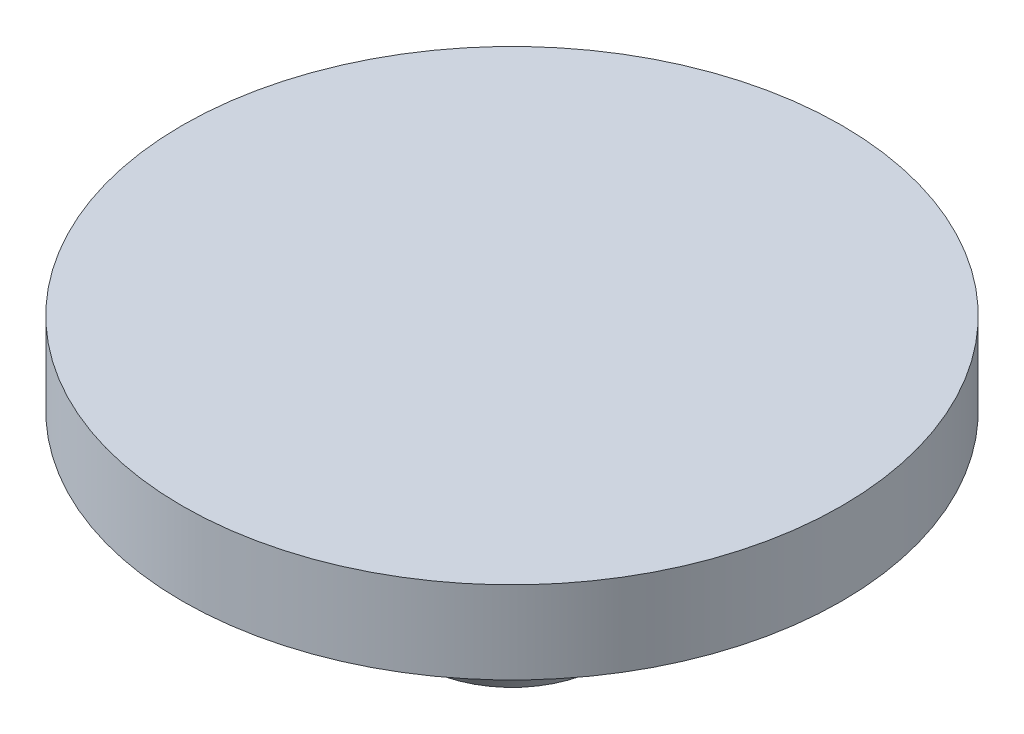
from build123d import *

# Parameters (mm, degrees)
SKETCH1_R           = 12.7
BOSS_EXTRUDE1_DEPTH = 3.175
SKETCH2_R           = 4.7625
BOSS_EXTRUDE2_DEPTH = 1.5875


with BuildPart() as part:
    # Sketch1 → Boss-Extrude1 (new body)
    with BuildSketch(Plane(origin=(0, 0, 0), x_dir=(1, 0, 0), z_dir=(0, 1, 0))):
        with Locations(Location((0, 0, 0), (0, 0, 270))):
            Circle(SKETCH1_R)
    extrude(amount=BOSS_EXTRUDE1_DEPTH)

    # Sketch2 → Boss-Extrude2 (add)
    with BuildSketch(Plane.XZ):
        with Locations(Location((0, 0, 0), (0, 0, 90))):
            Circle(SKETCH2_R)
    extrude(amount=BOSS_EXTRUDE2_DEPTH)

    # Sketch3 → Revolve1 (revolve)
    with BuildSketch(Plane(origin=(0, 0, 0), x_dir=(0, 0, -1), z_dir=(1, 0, 0)), mode=Mode.PRIVATE) as revolve1_sk:
        Polygon((0, -1.5875), (6.35, -1.5875), (3.5687, -6.7056), (0, -6.7056), align=None)
    revolve(revolve1_sk.sketch.rotate(Axis((0, 0, 0), (0, -1, 0)), 180), axis=Axis((0, 0, 0), (0, -1, 0)))


solid = part.part
